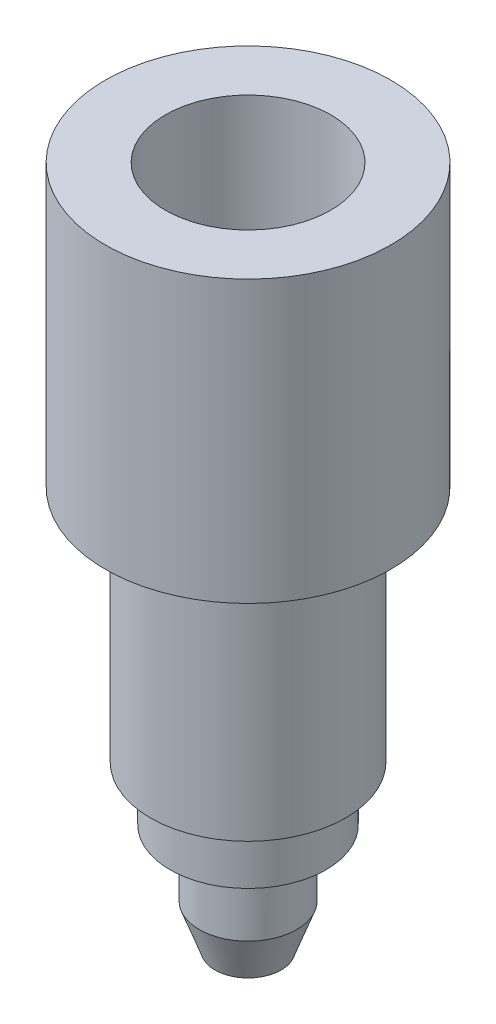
from build123d import *

# Parameters (mm, degrees)
FILLET1_R = 0.508


with BuildPart() as part:
    # Sketch1 → Revolve1 (revolve)
    with BuildSketch(Plane.XY, mode=Mode.PRIVATE) as revolve1_sk:
        Polygon((-1.27, 12.6746), (-2.6924, 15.2146), (-2.6924, 22.225), (-4.6482, 22.225), (-4.6482, 13.081), (-3.937, 13.081), (-3.175, 12.319), (-3.175, 5.334), (-2.54, 5.334), (-2.54, 3.556), (-1.5875, 3.556), (-1.5875, 1.395718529), (-1.0795, 0), (0, 0), (0, 12.6746), align=None)
    revolve(revolve1_sk.sketch.rotate(Axis((0, 0, 0), (0, 1, 0)), 270), axis=Axis((0, 0, 0), (0, 1, 0)))

    # Fillet1
    fillet1_edges = [part.edges().sort_by_distance(p)[0] for p in [
        (0, 3.556, 1.5875),
    ]]
    fillet(fillet1_edges, radius=FILLET1_R)


solid = part.part
